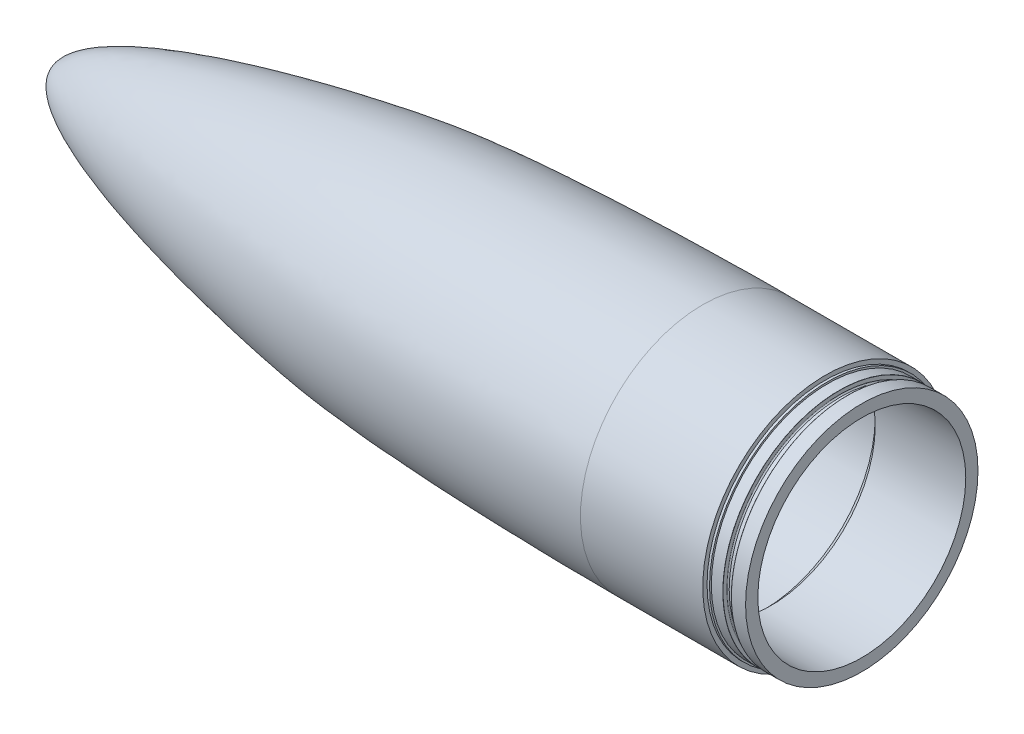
ISO-10303-21;
HEADER;
FILE_DESCRIPTION(('STEP AP214'),'2;1');
FILE_NAME('part.step','',(''),(''),'','','');
FILE_SCHEMA(('AUTOMOTIVE_DESIGN { 1 0 10303 214 1 1 1 1 }'));
ENDSEC;
DATA;
#1=APPLICATION_CONTEXT('core data for automotive mechanical design processes');
#2=APPLICATION_PROTOCOL_DEFINITION('international standard','automotive_design',2000,#1);
#3=PRODUCT_CONTEXT('',#1,'mechanical');
#4=PRODUCT('Part','Part','',(#3));
#5=PRODUCT_RELATED_PRODUCT_CATEGORY('part','',(#4));
#6=PRODUCT_DEFINITION_FORMATION('','',#4);
#7=PRODUCT_DEFINITION_CONTEXT('part definition',#1,'design');
#8=PRODUCT_DEFINITION('design','',#6,#7);
#9=PRODUCT_DEFINITION_SHAPE('','',#8);
#10=(LENGTH_UNIT() NAMED_UNIT(*) SI_UNIT(.MILLI.,.METRE.));
#11=(NAMED_UNIT(*) PLANE_ANGLE_UNIT() SI_UNIT($,.RADIAN.));
#12=(NAMED_UNIT(*) SI_UNIT($,.STERADIAN.) SOLID_ANGLE_UNIT());
#13=UNCERTAINTY_MEASURE_WITH_UNIT(LENGTH_MEASURE(1.E-05),#10,'distance_accuracy_value','');
#14=(GEOMETRIC_REPRESENTATION_CONTEXT(3) GLOBAL_UNCERTAINTY_ASSIGNED_CONTEXT((#13)) GLOBAL_UNIT_ASSIGNED_CONTEXT((#10,
#11,#12)) REPRESENTATION_CONTEXT('',''));
#15=CARTESIAN_POINT('',(0.,0.,0.));
#16=DIRECTION('',(0.,0.,1.));
#17=DIRECTION('',(1.,0.,0.));
#18=AXIS2_PLACEMENT_3D('',#15,#16,#17);
#19=CARTESIAN_POINT('',(0.,100.,0.));
#20=DIRECTION('',(1.,0.,0.));
#21=DIRECTION('',(0.,0.,-1.));
#22=AXIS2_PLACEMENT_3D('',#19,#20,#21);
#23=PLANE('',#22);
#24=CARTESIAN_POINT('',(0.,0.,0.));
#25=DIRECTION('',(1.,0.,0.));
#26=DIRECTION('',(0.,0.,-1.));
#27=AXIS2_PLACEMENT_3D('',#24,#25,#26);
#28=CIRCLE('',#27,100.);
#29=CARTESIAN_POINT('',(0.,0.,-100.));
#30=VERTEX_POINT('',#29);
#31=EDGE_CURVE('E55',#30,#30,#28,.T.);
#32=ORIENTED_EDGE('',*,*,#31,.T.);
#33=EDGE_LOOP('',(#32));
#34=FACE_BOUND('',#33,.T.);
#35=CARTESIAN_POINT('',(0.,0.,0.));
#36=DIRECTION('',(1.,0.,0.));
#37=DIRECTION('',(0.,0.,-1.));
#38=AXIS2_PLACEMENT_3D('',#35,#36,#37);
#39=CIRCLE('',#38,96.5);
#40=CARTESIAN_POINT('',(0.,0.,-96.5));
#41=VERTEX_POINT('',#40);
#42=EDGE_CURVE('E11',#41,#41,#39,.T.);
#43=ORIENTED_EDGE('',*,*,#42,.F.);
#44=EDGE_LOOP('',(#43));
#45=FACE_BOUND('',#44,.T.);
#46=ADVANCED_FACE('F31',(#34,#45),#23,.T.);
#47=CARTESIAN_POINT('',(20.1449982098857,0.,0.));
#48=DIRECTION('',(1.,0.,0.));
#49=DIRECTION('',(0.,0.,-1.));
#50=AXIS2_PLACEMENT_3D('',#47,#48,#49);
#51=CYLINDRICAL_SURFACE('',#50,96.5);
#52=ORIENTED_EDGE('',*,*,#42,.T.);
#53=EDGE_LOOP('',(#52));
#54=FACE_BOUND('',#53,.T.);
#55=CARTESIAN_POINT('',(2.,0.,0.));
#56=DIRECTION('',(1.,0.,0.));
#57=DIRECTION('',(0.,0.,-1.));
#58=AXIS2_PLACEMENT_3D('',#55,#56,#57);
#59=CIRCLE('',#58,96.5);
#60=CARTESIAN_POINT('',(2.,0.,-96.5));
#61=VERTEX_POINT('',#60);
#62=EDGE_CURVE('E38',#61,#61,#59,.T.);
#63=ORIENTED_EDGE('',*,*,#62,.F.);
#64=EDGE_LOOP('',(#63));
#65=FACE_BOUND('',#64,.T.);
#66=ADVANCED_FACE('F113',(#54,#65),#51,.T.);
#67=CARTESIAN_POINT('',(2.,95.,0.));
#68=DIRECTION('',(1.,0.,0.));
#69=DIRECTION('',(0.,0.,-1.));
#70=AXIS2_PLACEMENT_3D('',#67,#68,#69);
#71=PLANE('',#70);
#72=ORIENTED_EDGE('',*,*,#62,.T.);
#73=EDGE_LOOP('',(#72));
#74=FACE_BOUND('',#73,.T.);
#75=CARTESIAN_POINT('',(2.,0.,0.));
#76=DIRECTION('',(1.,0.,0.));
#77=DIRECTION('',(0.,0.,-1.));
#78=AXIS2_PLACEMENT_3D('',#75,#76,#77);
#79=CIRCLE('',#78,95.);
#80=CARTESIAN_POINT('',(2.,0.,-95.));
#81=VERTEX_POINT('',#80);
#82=EDGE_CURVE('E105',#81,#81,#79,.T.);
#83=ORIENTED_EDGE('',*,*,#82,.F.);
#84=EDGE_LOOP('',(#83));
#85=FACE_BOUND('',#84,.T.);
#86=ADVANCED_FACE('F110',(#74,#85),#71,.T.);
#87=CARTESIAN_POINT('',(20.1449982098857,0.,0.));
#88=DIRECTION('',(1.,0.,0.));
#89=DIRECTION('',(0.,0.,-1.));
#90=AXIS2_PLACEMENT_3D('',#87,#88,#89);
#91=CYLINDRICAL_SURFACE('',#90,95.);
#92=ORIENTED_EDGE('',*,*,#82,.T.);
#93=EDGE_LOOP('',(#92));
#94=FACE_BOUND('',#93,.T.);
#95=CARTESIAN_POINT('',(11.4,0.,0.));
#96=DIRECTION('',(1.,0.,0.));
#97=DIRECTION('',(0.,0.,-1.));
#98=AXIS2_PLACEMENT_3D('',#95,#96,#97);
#99=CIRCLE('',#98,95.);
#100=CARTESIAN_POINT('',(11.4,0.,-95.));
#101=VERTEX_POINT('',#100);
#102=EDGE_CURVE('E102',#101,#101,#99,.T.);
#103=ORIENTED_EDGE('',*,*,#102,.F.);
#104=EDGE_LOOP('',(#103));
#105=FACE_BOUND('',#104,.T.);
#106=ADVANCED_FACE('F120',(#94,#105),#91,.T.);
#107=CARTESIAN_POINT('',(11.4,0.,0.));
#108=DIRECTION('',(1.,0.,0.));
#109=DIRECTION('',(0.,0.,-1.));
#110=AXIS2_PLACEMENT_3D('',#107,#108,#109);
#111=TOROIDAL_SURFACE('',#110,94.9,0.100000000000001);
#112=ORIENTED_EDGE('',*,*,#102,.T.);
#113=EDGE_LOOP('',(#112));
#114=FACE_BOUND('',#113,.T.);
#115=CARTESIAN_POINT('',(11.5,0.,0.));
#116=DIRECTION('',(1.,0.,0.));
#117=DIRECTION('',(0.,0.,-1.));
#118=AXIS2_PLACEMENT_3D('',#115,#116,#117);
#119=CIRCLE('',#118,94.9);
#120=CARTESIAN_POINT('',(11.5,0.,-94.9));
#121=VERTEX_POINT('',#120);
#122=EDGE_CURVE('E99',#121,#121,#119,.T.);
#123=ORIENTED_EDGE('',*,*,#122,.F.);
#124=EDGE_LOOP('',(#123));
#125=FACE_BOUND('',#124,.T.);
#126=ADVANCED_FACE('F126',(#114,#125),#111,.T.);
#127=CARTESIAN_POINT('',(11.5,94.9,0.));
#128=DIRECTION('',(1.,0.,0.));
#129=DIRECTION('',(0.,0.,-1.));
#130=AXIS2_PLACEMENT_3D('',#127,#128,#129);
#131=PLANE('',#130);
#132=ORIENTED_EDGE('',*,*,#122,.T.);
#133=EDGE_LOOP('',(#132));
#134=FACE_BOUND('',#133,.T.);
#135=CARTESIAN_POINT('',(11.5,0.,0.));
#136=DIRECTION('',(1.,0.,0.));
#137=DIRECTION('',(0.,0.,-1.));
#138=AXIS2_PLACEMENT_3D('',#135,#136,#137);
#139=CIRCLE('',#138,91.9);
#140=CARTESIAN_POINT('',(11.5,0.,-91.9));
#141=VERTEX_POINT('',#140);
#142=EDGE_CURVE('E96',#141,#141,#139,.T.);
#143=ORIENTED_EDGE('',*,*,#142,.F.);
#144=EDGE_LOOP('',(#143));
#145=FACE_BOUND('',#144,.T.);
#146=ADVANCED_FACE('F130',(#134,#145),#131,.T.);
#147=CARTESIAN_POINT('',(12.5,0.,0.));
#148=DIRECTION('',(1.,0.,0.));
#149=DIRECTION('',(0.,0.,-1.));
#150=AXIS2_PLACEMENT_3D('',#147,#148,#149);
#151=TOROIDAL_SURFACE('',#150,91.9,1.);
#152=ORIENTED_EDGE('',*,*,#142,.T.);
#153=EDGE_LOOP('',(#152));
#154=FACE_BOUND('',#153,.T.);
#155=CARTESIAN_POINT('',(12.5,0.,0.));
#156=DIRECTION('',(1.,0.,0.));
#157=DIRECTION('',(0.,0.,-1.));
#158=AXIS2_PLACEMENT_3D('',#155,#156,#157);
#159=CIRCLE('',#158,90.9);
#160=CARTESIAN_POINT('',(12.5,0.,-90.9));
#161=VERTEX_POINT('',#160);
#162=EDGE_CURVE('E93',#161,#161,#159,.T.);
#163=ORIENTED_EDGE('',*,*,#162,.F.);
#164=EDGE_LOOP('',(#163));
#165=FACE_BOUND('',#164,.T.);
#166=ADVANCED_FACE('F134',(#154,#165),#151,.F.);
#167=CARTESIAN_POINT('',(20.1449982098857,0.,0.));
#168=DIRECTION('',(1.,0.,0.));
#169=DIRECTION('',(0.,0.,-1.));
#170=AXIS2_PLACEMENT_3D('',#167,#168,#169);
#171=CYLINDRICAL_SURFACE('',#170,90.9);
#172=ORIENTED_EDGE('',*,*,#162,.T.);
#173=EDGE_LOOP('',(#172));
#174=FACE_BOUND('',#173,.T.);
#175=CARTESIAN_POINT('',(17.3,0.,0.));
#176=DIRECTION('',(1.,0.,0.));
#177=DIRECTION('',(0.,0.,-1.));
#178=AXIS2_PLACEMENT_3D('',#175,#176,#177);
#179=CIRCLE('',#178,90.9);
#180=CARTESIAN_POINT('',(17.3,0.,-90.9));
#181=VERTEX_POINT('',#180);
#182=EDGE_CURVE('E90',#181,#181,#179,.T.);
#183=ORIENTED_EDGE('',*,*,#182,.F.);
#184=EDGE_LOOP('',(#183));
#185=FACE_BOUND('',#184,.T.);
#186=ADVANCED_FACE('F138',(#174,#185),#171,.T.);
#187=CARTESIAN_POINT('',(17.3,0.,0.));
#188=DIRECTION('',(1.,0.,0.));
#189=DIRECTION('',(0.,0.,-1.));
#190=AXIS2_PLACEMENT_3D('',#187,#188,#189);
#191=TOROIDAL_SURFACE('',#190,91.9,1.);
#192=ORIENTED_EDGE('',*,*,#182,.T.);
#193=EDGE_LOOP('',(#192));
#194=FACE_BOUND('',#193,.T.);
#195=CARTESIAN_POINT('',(18.3,0.,0.));
#196=DIRECTION('',(1.,0.,0.));
#197=DIRECTION('',(0.,0.,-1.));
#198=AXIS2_PLACEMENT_3D('',#195,#196,#197);
#199=CIRCLE('',#198,91.9);
#200=CARTESIAN_POINT('',(18.3,0.,-91.9));
#201=VERTEX_POINT('',#200);
#202=EDGE_CURVE('E87',#201,#201,#199,.T.);
#203=ORIENTED_EDGE('',*,*,#202,.F.);
#204=EDGE_LOOP('',(#203));
#205=FACE_BOUND('',#204,.T.);
#206=ADVANCED_FACE('F142',(#194,#205),#191,.F.);
#207=CARTESIAN_POINT('',(18.3,94.9,0.));
#208=DIRECTION('',(-1.,0.,0.));
#209=DIRECTION('',(0.,0.,1.));
#210=AXIS2_PLACEMENT_3D('',#207,#208,#209);
#211=PLANE('',#210);
#212=ORIENTED_EDGE('',*,*,#202,.T.);
#213=EDGE_LOOP('',(#212));
#214=FACE_BOUND('',#213,.T.);
#215=CARTESIAN_POINT('',(18.3,0.,0.));
#216=DIRECTION('',(1.,0.,0.));
#217=DIRECTION('',(0.,0.,-1.));
#218=AXIS2_PLACEMENT_3D('',#215,#216,#217);
#219=CIRCLE('',#218,94.9);
#220=CARTESIAN_POINT('',(18.3,0.,-94.9));
#221=VERTEX_POINT('',#220);
#222=EDGE_CURVE('E84',#221,#221,#219,.T.);
#223=ORIENTED_EDGE('',*,*,#222,.F.);
#224=EDGE_LOOP('',(#223));
#225=FACE_BOUND('',#224,.T.);
#226=ADVANCED_FACE('F146',(#214,#225),#211,.T.);
#227=CARTESIAN_POINT('',(18.4,0.,0.));
#228=DIRECTION('',(1.,0.,0.));
#229=DIRECTION('',(0.,0.,-1.));
#230=AXIS2_PLACEMENT_3D('',#227,#228,#229);
#231=TOROIDAL_SURFACE('',#230,94.9,0.100000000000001);
#232=ORIENTED_EDGE('',*,*,#222,.T.);
#233=EDGE_LOOP('',(#232));
#234=FACE_BOUND('',#233,.T.);
#235=CARTESIAN_POINT('',(18.4,0.,0.));
#236=DIRECTION('',(1.,0.,0.));
#237=DIRECTION('',(0.,0.,-1.));
#238=AXIS2_PLACEMENT_3D('',#235,#236,#237);
#239=CIRCLE('',#238,95.);
#240=CARTESIAN_POINT('',(18.4,0.,-95.));
#241=VERTEX_POINT('',#240);
#242=EDGE_CURVE('E81',#241,#241,#239,.T.);
#243=ORIENTED_EDGE('',*,*,#242,.F.);
#244=EDGE_LOOP('',(#243));
#245=FACE_BOUND('',#244,.T.);
#246=ADVANCED_FACE('F150',(#234,#245),#231,.T.);
#247=CARTESIAN_POINT('',(20.1449982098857,0.,0.));
#248=DIRECTION('',(1.,0.,0.));
#249=DIRECTION('',(0.,0.,-1.));
#250=AXIS2_PLACEMENT_3D('',#247,#248,#249);
#251=CYLINDRICAL_SURFACE('',#250,95.);
#252=ORIENTED_EDGE('',*,*,#242,.T.);
#253=EDGE_LOOP('',(#252));
#254=FACE_BOUND('',#253,.T.);
#255=CARTESIAN_POINT('',(30.,0.,0.));
#256=DIRECTION('',(1.,0.,0.));
#257=DIRECTION('',(0.,0.,-1.));
#258=AXIS2_PLACEMENT_3D('',#255,#256,#257);
#259=CIRCLE('',#258,95.);
#260=CARTESIAN_POINT('',(30.,0.,-95.));
#261=VERTEX_POINT('',#260);
#262=EDGE_CURVE('E78',#261,#261,#259,.T.);
#263=ORIENTED_EDGE('',*,*,#262,.F.);
#264=EDGE_LOOP('',(#263));
#265=FACE_BOUND('',#264,.T.);
#266=ADVANCED_FACE('F154',(#254,#265),#251,.T.);
#267=CARTESIAN_POINT('',(30.,95.,0.));
#268=DIRECTION('',(1.,0.,0.));
#269=DIRECTION('',(0.,0.,-1.));
#270=AXIS2_PLACEMENT_3D('',#267,#268,#269);
#271=PLANE('',#270);
#272=ORIENTED_EDGE('',*,*,#262,.T.);
#273=EDGE_LOOP('',(#272));
#274=FACE_BOUND('',#273,.T.);
#275=CARTESIAN_POINT('',(30.,0.,0.));
#276=DIRECTION('',(1.,0.,0.));
#277=DIRECTION('',(0.,0.,-1.));
#278=AXIS2_PLACEMENT_3D('',#275,#276,#277);
#279=CIRCLE('',#278,85.);
#280=CARTESIAN_POINT('',(30.,0.,-85.));
#281=VERTEX_POINT('',#280);
#282=EDGE_CURVE('E75',#281,#281,#279,.T.);
#283=ORIENTED_EDGE('',*,*,#282,.F.);
#284=EDGE_LOOP('',(#283));
#285=FACE_BOUND('',#284,.T.);
#286=ADVANCED_FACE('F158',(#274,#285),#271,.T.);
#287=CARTESIAN_POINT('',(20.1449982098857,0.,0.));
#288=DIRECTION('',(1.,0.,0.));
#289=DIRECTION('',(0.,0.,-1.));
#290=AXIS2_PLACEMENT_3D('',#287,#288,#289);
#291=CYLINDRICAL_SURFACE('',#290,85.);
#292=ORIENTED_EDGE('',*,*,#282,.T.);
#293=EDGE_LOOP('',(#292));
#294=FACE_BOUND('',#293,.T.);
#295=CARTESIAN_POINT('',(-44.0069108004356,0.,0.));
#296=DIRECTION('',(1.,0.,0.));
#297=DIRECTION('',(0.,0.,-1.));
#298=AXIS2_PLACEMENT_3D('',#295,#296,#297);
#299=CIRCLE('',#298,85.);
#300=CARTESIAN_POINT('',(-44.0069108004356,0.,-85.));
#301=VERTEX_POINT('',#300);
#302=EDGE_CURVE('E72',#301,#301,#299,.T.);
#303=ORIENTED_EDGE('',*,*,#302,.F.);
#304=EDGE_LOOP('',(#303));
#305=FACE_BOUND('',#304,.T.);
#306=ADVANCED_FACE('F162',(#294,#305),#291,.F.);
#307=CARTESIAN_POINT('',(-50.0000000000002,0.,0.));
#308=DIRECTION('',(-1.,0.,0.));
#309=DIRECTION('',(0.,0.,1.));
#310=AXIS2_PLACEMENT_3D('',#307,#308,#309);
#311=CONICAL_SURFACE('',#310,90.9930891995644,0.785398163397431);
#312=ORIENTED_EDGE('',*,*,#302,.T.);
#313=EDGE_LOOP('',(#312));
#314=FACE_BOUND('',#313,.T.);
#315=CARTESIAN_POINT('',(-50.0000000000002,0.,0.));
#316=DIRECTION('',(1.,0.,0.));
#317=DIRECTION('',(0.,0.,-1.));
#318=AXIS2_PLACEMENT_3D('',#315,#316,#317);
#319=CIRCLE('',#318,90.9930891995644);
#320=CARTESIAN_POINT('',(-50.0000000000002,0.,-90.9930891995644));
#321=VERTEX_POINT('',#320);
#322=EDGE_CURVE('E69',#321,#321,#319,.T.);
#323=ORIENTED_EDGE('',*,*,#322,.F.);
#324=EDGE_LOOP('',(#323));
#325=FACE_BOUND('',#324,.T.);
#326=ADVANCED_FACE('F166',(#314,#325),#311,.F.);
#327=CARTESIAN_POINT('',(20.1449982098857,0.,0.));
#328=DIRECTION('',(1.,0.,0.));
#329=DIRECTION('',(0.,0.,-1.));
#330=AXIS2_PLACEMENT_3D('',#327,#328,#329);
#331=CYLINDRICAL_SURFACE('',#330,90.9930891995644);
#332=ORIENTED_EDGE('',*,*,#322,.T.);
#333=EDGE_LOOP('',(#332));
#334=FACE_BOUND('',#333,.T.);
#335=CARTESIAN_POINT('',(-177.006910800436,0.,0.));
#336=DIRECTION('',(1.,0.,0.));
#337=DIRECTION('',(0.,0.,-1.));
#338=AXIS2_PLACEMENT_3D('',#335,#336,#337);
#339=CIRCLE('',#338,90.9930891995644);
#340=CARTESIAN_POINT('',(-177.006910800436,0.,-90.9930891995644));
#341=VERTEX_POINT('',#340);
#342=EDGE_CURVE('E66',#341,#341,#339,.T.);
#343=ORIENTED_EDGE('',*,*,#342,.F.);
#344=EDGE_LOOP('',(#343));
#345=FACE_BOUND('',#344,.T.);
#346=ADVANCED_FACE('F170',(#334,#345),#331,.F.);
#347=CARTESIAN_POINT('',(-178.987716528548,0.,0.));
#348=DIRECTION('',(1.,0.,0.));
#349=DIRECTION('',(0.,0.,-1.));
#350=AXIS2_PLACEMENT_3D('',#347,#348,#349);
#351=CONICAL_SURFACE('',#350,89.0122834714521,0.785398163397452);
#352=ORIENTED_EDGE('',*,*,#342,.T.);
#353=EDGE_LOOP('',(#352));
#354=FACE_BOUND('',#353,.T.);
#355=CARTESIAN_POINT('',(-178.987716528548,0.,0.));
#356=DIRECTION('',(1.,0.,0.));
#357=DIRECTION('',(0.,0.,-1.));
#358=AXIS2_PLACEMENT_3D('',#355,#356,#357);
#359=CIRCLE('',#358,89.0122834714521);
#360=CARTESIAN_POINT('',(-178.987716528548,0.,-89.0122834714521));
#361=VERTEX_POINT('',#360);
#362=EDGE_CURVE('E58',#361,#361,#359,.T.);
#363=ORIENTED_EDGE('',*,*,#362,.F.);
#364=EDGE_LOOP('',(#363));
#365=FACE_BOUND('',#364,.T.);
#366=ADVANCED_FACE('F174',(#354,#365),#351,.F.);
#367=CARTESIAN_POINT('',(20.1449982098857,0.,0.));
#368=DIRECTION('',(1.,0.,0.));
#369=DIRECTION('',(0.,0.,-1.));
#370=AXIS2_PLACEMENT_3D('',#367,#368,#369);
#371=CYLINDRICAL_SURFACE('',#370,89.0122831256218);
#372=ORIENTED_EDGE('',*,*,#362,.T.);
#373=EDGE_LOOP('',(#372));
#374=FACE_BOUND('',#373,.T.);
#375=CARTESIAN_POINT('',(-280.170467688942,0.,0.));
#376=DIRECTION('',(1.,0.,0.));
#377=DIRECTION('',(0.,0.,-1.));
#378=AXIS2_PLACEMENT_3D('',#375,#376,#377);
#379=CIRCLE('',#378,89.0122827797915);
#380=CARTESIAN_POINT('',(-280.170467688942,0.,-89.0122827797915));
#381=VERTEX_POINT('',#380);
#382=EDGE_CURVE('E54',#381,#381,#379,.T.);
#383=ORIENTED_EDGE('',*,*,#382,.F.);
#384=EDGE_LOOP('',(#383));
#385=FACE_BOUND('',#384,.T.);
#386=ADVANCED_FACE('F178',(#374,#385),#371,.F.);
#387=CARTESIAN_POINT('',(-623.6,-5.10209001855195E-13,0.));
#388=CARTESIAN_POINT('',(-623.6,0.514775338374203,0.));
#389=CARTESIAN_POINT('',(-623.496626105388,1.49731705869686,0.));
#390=CARTESIAN_POINT('',(-622.975069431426,3.20049424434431,0.));
#391=CARTESIAN_POINT('',(-621.986149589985,5.12944624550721,0.));
#392=CARTESIAN_POINT('',(-619.952563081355,7.98896913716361,0.));
#393=CARTESIAN_POINT('',(-615.99584158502,11.9561572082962,0.));
#394=CARTESIAN_POINT('',(-609.082536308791,16.9895323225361,0.));
#395=CARTESIAN_POINT('',(-600.22873381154,22.1067094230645,0.));
#396=CARTESIAN_POINT('',(-586.122698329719,28.9140545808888,0.));
#397=CARTESIAN_POINT('',(-564.687362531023,37.2523901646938,0.));
#398=CARTESIAN_POINT('',(-534.375414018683,46.7481823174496,0.));
#399=CARTESIAN_POINT('',(-500.879191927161,55.5929356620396,0.));
#400=CARTESIAN_POINT('',(-465.57588554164,63.6675556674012,0.));
#401=CARTESIAN_POINT('',(-429.81443321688,70.8620003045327,0.));
#402=CARTESIAN_POINT('',(-400.788613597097,76.0403440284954,0.));
#403=CARTESIAN_POINT('',(-378.640427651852,79.6320549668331,0.));
#404=CARTESIAN_POINT('',(-361.694701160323,82.05084837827,0.));
#405=CARTESIAN_POINT('',(-343.634458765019,84.2012174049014,0.));
#406=CARTESIAN_POINT('',(-323.575500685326,86.0883050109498,0.));
#407=CARTESIAN_POINT('',(-301.850988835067,87.7262534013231,0.));
#408=CARTESIAN_POINT('',(-278.897022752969,89.1276971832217,0.));
#409=CARTESIAN_POINT('',(-255.11633638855,90.3072160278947,0.));
#410=CARTESIAN_POINT('',(-230.917319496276,91.2796006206,0.));
#411=CARTESIAN_POINT('',(-206.704954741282,92.0599583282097,0.));
#412=CARTESIAN_POINT('',(-182.884021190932,92.6635149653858,0.));
#413=CARTESIAN_POINT('',(-163.69625617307,93.0319040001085,0.));
#414=CARTESIAN_POINT('',(-148.94588346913,93.2535512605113,0.));
#415=CARTESIAN_POINT('',(-138.233517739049,93.3851788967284,0.));
#416=CARTESIAN_POINT('',(-127.922147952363,93.4841243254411,0.));
#417=CARTESIAN_POINT('',(-119.705449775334,93.5409502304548,0.));
#418=CARTESIAN_POINT('',(-113.383462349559,93.5719989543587,0.));
#419=CARTESIAN_POINT('',(-108.772962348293,93.5883211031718,0.));
#420=CARTESIAN_POINT('',(-105.048807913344,93.5963207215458,0.));
#421=CARTESIAN_POINT('',(-102.135556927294,93.5994801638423,0.));
#422=CARTESIAN_POINT('',(-100.71484516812,93.6,0.));
#423=CARTESIAN_POINT('',(-100.,93.6,0.));
#424=B_SPLINE_CURVE_WITH_KNOTS('',3,(#387,#388,#389,#390,#391,#392,#393,#394,#395,#396,#397,
#398,#399,#400,#401,#402,#403,#404,#405,#406,#407,#408,#409,#410,#411,#412,#413,#414,#415,#416,
#417,#418,#419,#420,#421,#422,#423),.UNSPECIFIED.,.F.,.F.,(4,1,1,1,1,1,1,1,1,1,1,1,1,1,1,1,1,1,
1,1,1,1,1,1,1,1,1,1,1,1,1,1,1,1,4),(0.,0.015625,0.03125,0.046875,0.0625,0.09375,0.125,0.15625,
0.1875,0.25,0.3125,0.375,0.4375,0.5,0.5625,0.59375,0.625,0.65625,0.6875,0.71875,0.75,0.78125,
0.8125,0.84375,0.875,0.90625,0.921875,0.9375,0.953125,0.96875,0.9765625,0.984375,0.9921875,
0.99609375,1.),.UNSPECIFIED.);
#425=CARTESIAN_POINT('',(20.1449982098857,0.,0.));
#426=DIRECTION('',(1.,0.,0.));
#427=AXIS1_PLACEMENT('',#425,#426);
#428=SURFACE_OF_REVOLUTION('',#424,#427);
#429=ORIENTED_EDGE('',*,*,#382,.T.);
#430=EDGE_LOOP('',(#429));
#431=FACE_BOUND('',#430,.T.);
#432=CARTESIAN_POINT('',(-623.6,-5.10209001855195E-13,0.));
#433=VERTEX_POINT('',#432);
#434=VERTEX_LOOP('',#433);
#435=FACE_BOUND('',#434,.T.);
#436=ADVANCED_FACE('F48',(#431,#435),#428,.F.);
#437=CARTESIAN_POINT('',(-100.,100.,0.));
#438=CARTESIAN_POINT('',(-162.133323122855,100.,0.));
#439=CARTESIAN_POINT('',(-304.534862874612,97.422570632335,0.));
#440=CARTESIAN_POINT('',(-476.671134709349,71.3102613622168,0.));
#441=CARTESIAN_POINT('',(-630.,34.0847555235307,0.));
#442=CARTESIAN_POINT('',(-630.,-5.63368016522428E-13,0.));
#443=B_SPLINE_CURVE_WITH_KNOTS('',3,(#437,#438,#439,#440,#441,#442),.UNSPECIFIED.,.F.,.F.,(4,1,
1,4),(0.,0.341762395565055,0.441762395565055,1.),.UNSPECIFIED.);
#444=CARTESIAN_POINT('',(20.1449982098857,0.,0.));
#445=DIRECTION('',(1.,0.,0.));
#446=AXIS1_PLACEMENT('',#444,#445);
#447=SURFACE_OF_REVOLUTION('',#443,#446);
#448=CARTESIAN_POINT('',(-630.,-5.63368016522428E-13,0.));
#449=VERTEX_POINT('',#448);
#450=VERTEX_LOOP('',#449);
#451=FACE_BOUND('',#450,.T.);
#452=CARTESIAN_POINT('',(-100.,0.,0.));
#453=DIRECTION('',(1.,0.,0.));
#454=DIRECTION('',(0.,0.,-1.));
#455=AXIS2_PLACEMENT_3D('',#452,#453,#454);
#456=CIRCLE('',#455,100.);
#457=CARTESIAN_POINT('',(-100.,0.,-100.));
#458=VERTEX_POINT('',#457);
#459=EDGE_CURVE('E52',#458,#458,#456,.T.);
#460=ORIENTED_EDGE('',*,*,#459,.F.);
#461=EDGE_LOOP('',(#460));
#462=FACE_BOUND('',#461,.T.);
#463=ADVANCED_FACE('F44',(#451,#462),#447,.F.);
#464=CARTESIAN_POINT('',(20.1449982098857,0.,0.));
#465=DIRECTION('',(1.,0.,0.));
#466=DIRECTION('',(0.,0.,-1.));
#467=AXIS2_PLACEMENT_3D('',#464,#465,#466);
#468=CYLINDRICAL_SURFACE('',#467,100.);
#469=ORIENTED_EDGE('',*,*,#459,.T.);
#470=EDGE_LOOP('',(#469));
#471=FACE_BOUND('',#470,.T.);
#472=ORIENTED_EDGE('',*,*,#31,.F.);
#473=EDGE_LOOP('',(#472));
#474=FACE_BOUND('',#473,.T.);
#475=ADVANCED_FACE('F47',(#471,#474),#468,.T.);
#476=CLOSED_SHELL('',(#46,#66,#86,#106,#126,#146,#166,#186,#206,#226,#246,#266,#286,#306,#326,
#346,#366,#386,#436,#463,#475));
#477=MANIFOLD_SOLID_BREP('B2',#476);
#478=ADVANCED_BREP_SHAPE_REPRESENTATION('',(#18,#477),#14);
#479=SHAPE_DEFINITION_REPRESENTATION(#9,#478);
ENDSEC;
END-ISO-10303-21;
